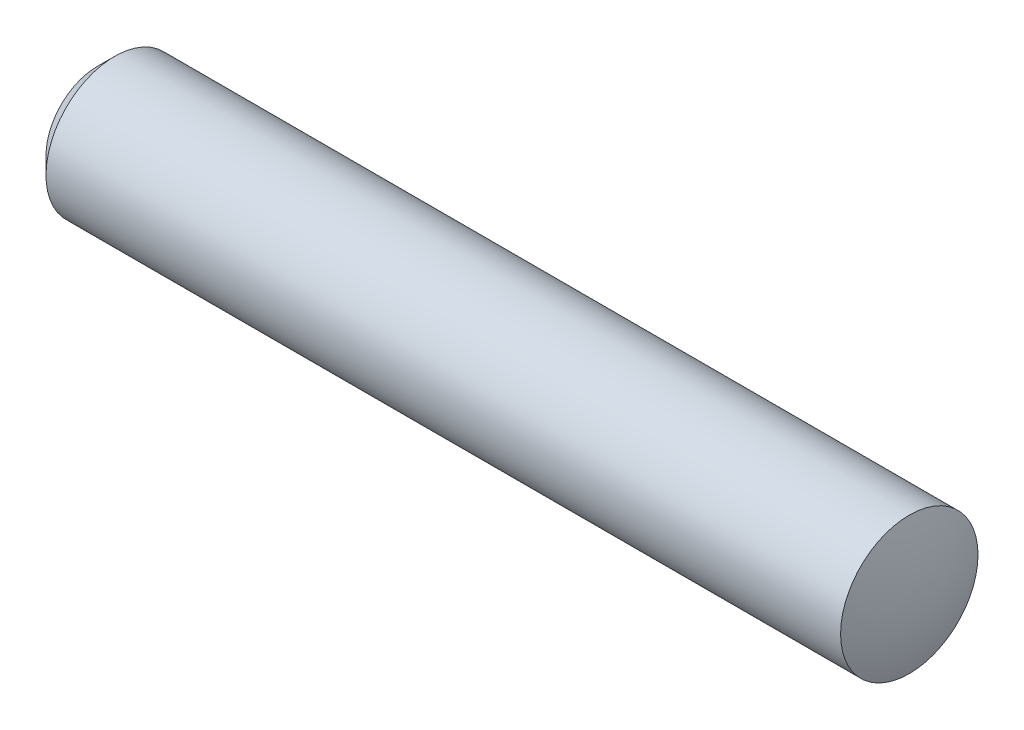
from build123d import *


with BuildPart() as part:
    # Sketch1 → Revolve1 (revolve)
    with BuildSketch(Plane.XY):
        with BuildLine():
            Line((-12.102315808, 1.5), (-11.602315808, 2))
            Line((-11.602315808, 2), (-6.102315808, 2))
            Line((-6.102315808, 2), (-2.102315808, 2))
            Line((-2.102315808, 2), (11.528362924, 2))
            ThreePointArc((11.528362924, 2), (11.80457991, 1.016906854), (11.897684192, 0))
            Line((11.897684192, 0), (-2.102315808, 0))
            Line((-2.102315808, 0), (-11.897684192, 0))
            ThreePointArc((-11.897684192, 0), (-11.949077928, 0.756946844), (-12.102315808, 1.5))
        make_face()
    revolve(axis=Axis((-11.897684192, 0, 0), (1, 0, 0)))


solid = part.part
